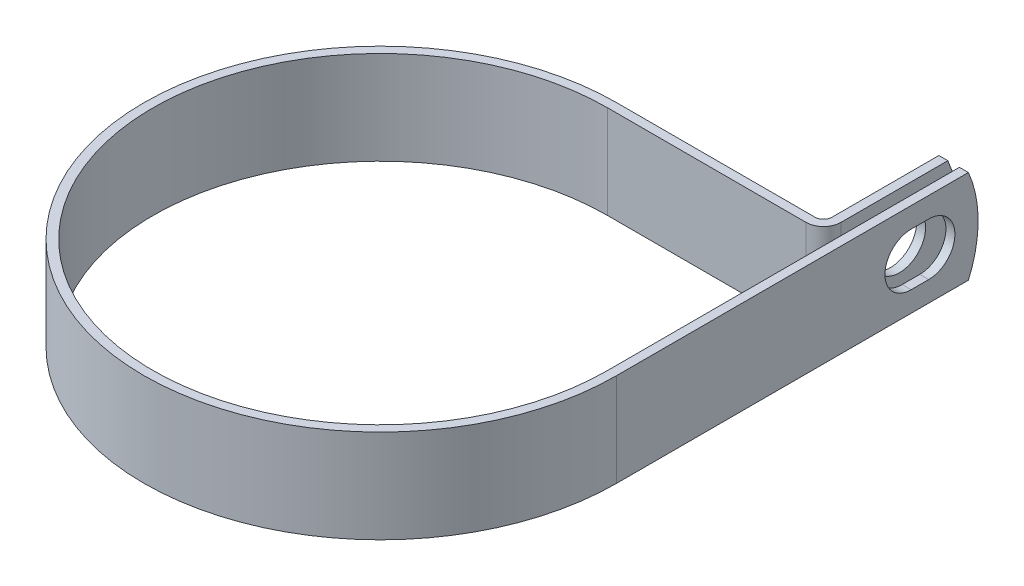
from build123d import *

# Parameters (mm, degrees)
EXTRUDE_THIN1_DEPTH = 6.35
SKETCH2_R           = 3.5687
CUT_EXTRUDE1_DEPTH  = 1.2192
CUT_EXTRUDE2_REACH  = 83.243
CUT_EXTRUDE3_DEPTH  = 79.102806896


with BuildPart() as part:
    # Sketch1 → Extrude-Thin1 (new, symmetric)
    with BuildSketch(Plane(origin=(0, 0, 0), x_dir=(1, 0, 0), z_dir=(0, 1, 0))):
        with BuildLine():
            Line((30.9499, 49.1998), (30.9499, 30.9499))
            Line((30.9499, 30.9499), (30.9499, 0))
            ThreePointArc((30.9499, 0), (-21.884884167, -21.884884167), (0, 30.9499))
            Line((0, 30.9499), (26.99766, 30.9499))
            ThreePointArc((26.99766, 30.9499), (28.678763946, 31.646236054), (29.3751, 33.32734))
            Line((29.3751, 33.32734), (29.3751, 49.1998))
            Line((29.3751, 49.1998), (28.1559, 49.1998))
            Line((28.1559, 49.1998), (28.1559, 33.32734))
            ThreePointArc((28.1559, 33.32734), (27.816659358, 32.508340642), (26.99766, 32.1691))
            Line((26.99766, 32.1691), (0, 32.1691))
            ThreePointArc((0, 32.1691), (-22.746988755, -22.746988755), (32.1691, 0))
            Line((32.1691, 0), (32.1691, 30.9499))
            Line((32.1691, 30.9499), (32.1691, 49.1998))
            Line((32.1691, 49.1998), (30.9499, 49.1998))
        make_face()
    extrude(amount=EXTRUDE_THIN1_DEPTH, both=True)

    # Sketch2 → Cut-Extrude1 (cut)
    with BuildSketch(Plane.ZY.offset(-28.1559)):
        with Locations((-41.275, 0)):
            Circle(SKETCH2_R)
    extrude(amount=-CUT_EXTRUDE1_DEPTH, mode=Mode.SUBTRACT)

    # Sketch3 → Cut-Extrude2 (cut, up to next)
    with BuildSketch(Plane(origin=(32.1691, 0, 0), x_dir=(0, 0, -1), z_dir=(1, 0, 0)), mode=Mode.PRIVATE) as cut_extrude2_sk1:
        with BuildLine():
            Line((40.0812, 3.5687), (42.4688, 3.5687))
            ThreePointArc((42.4688, 3.5687), (46.0375, 0), (42.4688, -3.5687))
            Line((42.4688, -3.5687), (40.0812, -3.5687))
            ThreePointArc((40.0812, -3.5687), (36.5125, 0), (40.0812, 3.5687))
        make_face()
    cut_extrude2_tool1 = extrude(cut_extrude2_sk1.sketch, amount=-CUT_EXTRUDE2_REACH, mode=Mode.PRIVATE) & part.part
    add(cut_extrude2_tool1.solids().sort_by_distance((32.1691, 0, -41.275))[0], mode=Mode.SUBTRACT)

    # Sketch4 → Cut-Extrude3 (cut, through all)
    with BuildSketch(Plane.ZY.offset(-28.1559)):
        with BuildLine():
            Line((-47.874477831, 6.35), (-49.1998, 6.35))
            Line((-49.1998, 6.35), (-49.1998, 5.4e-08))
            ThreePointArc((-49.1998, 5.4e-08), (-48.864937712, 3.24341562), (-47.874477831, 6.35))
        make_face()
        with BuildLine():
            ThreePointArc((-47.874477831, -6.35), (-48.864937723, -3.243415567), (-49.1998, 5.4e-08))
            Line((-49.1998, 5.4e-08), (-49.1998, -6.35))
            Line((-49.1998, -6.35), (-47.874477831, -6.35))
        make_face()
    extrude(amount=-CUT_EXTRUDE3_DEPTH, mode=Mode.SUBTRACT)


solid = part.part
